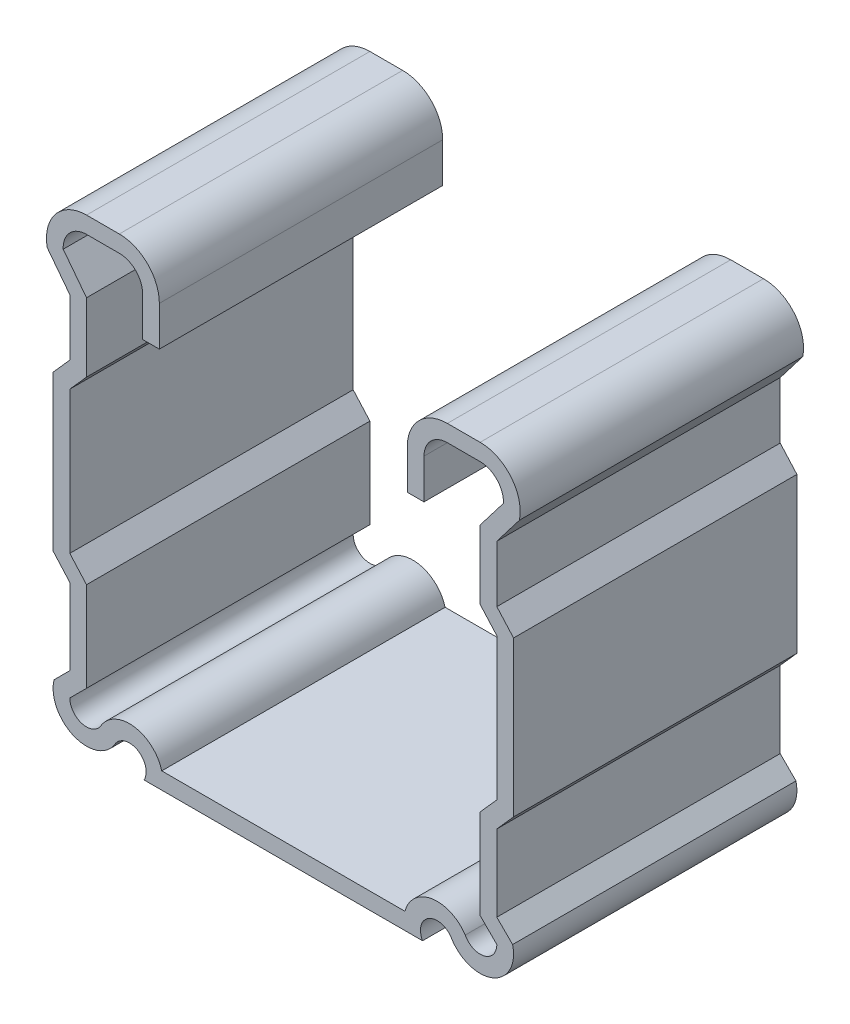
from build123d import *

# Parameters (mm, degrees)
BASE_EXTRUDE_DEPTH = 12.7


with BuildPart() as part:
    # Sketch1 → Base-Extrude (new, symmetric)
    with BuildSketch(Plane.XY):
        with BuildLine():
            Line((17.6403, 16.339286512), (19.729882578, 19.063533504))
            ThreePointArc((19.729882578, 19.063533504), (19.156045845, 20.609744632), (17.6403, 21.2598))
            Line((17.6403, 21.2598), (14.70327367, 21.2598))
            ThreePointArc((14.70327367, 21.2598), (13.223883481, 20.647016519), (12.6111, 19.16762633))
            Line((12.6111, 19.16762633), (12.6111, 15.61465))
            Line((12.6111, 15.61465), (11.1125, 15.61465))
            Line((11.1125, 15.61465), (11.1125, 19.16762633))
            ThreePointArc((11.1125, 19.16762633), (12.164213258, 21.706686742), (14.70327367, 22.7584))
            Line((14.70327367, 22.7584), (17.6403, 22.7584))
            ThreePointArc((17.6403, 22.7584), (20.415434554, 21.446284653), (21.162428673, 18.4688666))
            Line((21.162428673, 18.4688666), (19.1389, 15.830735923))
            Line((19.1389, 15.830735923), (19.1389, 10.749129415))
            Line((19.1389, 10.749129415), (20.6375, 9.0662125))
            Line((20.6375, 9.0662125), (20.6375, -4.8244125))
            Line((20.6375, -4.8244125), (19.1389, -6.507329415))
            Line((19.1389, -6.507329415), (19.1389, -13.358784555))
            Line((19.1389, -13.358784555), (20.553458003, -14.773342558))
            ThreePointArc((20.553458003, -14.773342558), (18.729942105, -18.270236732), (15.019825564, -16.932883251))
            ThreePointArc((15.019825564, -16.932883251), (13.000752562, -16.523120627), (12.480559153, -18.5166))
            Line((12.480559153, -18.5166), (-12.480559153, -18.5166))
            ThreePointArc((-12.480559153, -18.5166), (-13.000752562, -16.523120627), (-15.019825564, -16.932883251))
            ThreePointArc((-15.019825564, -16.932883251), (-18.729942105, -18.270236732), (-20.553458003, -14.773342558))
            Line((-20.553458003, -14.773342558), (-19.1389, -13.358784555))
            Line((-19.1389, -13.358784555), (-19.1389, -6.507329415))
            Line((-19.1389, -6.507329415), (-20.6375, -4.8244125))
            Line((-20.6375, -4.8244125), (-20.6375, 9.0662125))
            Line((-20.6375, 9.0662125), (-19.1389, 10.749129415))
            Line((-19.1389, 10.749129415), (-19.1389, 15.830735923))
            Line((-19.1389, 15.830735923), (-21.162428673, 18.4688666))
            ThreePointArc((-21.162428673, 18.4688666), (-20.415434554, 21.446284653), (-17.6403, 22.7584))
            Line((-17.6403, 22.7584), (-14.70327367, 22.7584))
            ThreePointArc((-14.70327367, 22.7584), (-12.164213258, 21.706686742), (-11.1125, 19.16762633))
            Line((-11.1125, 19.16762633), (-11.1125, 15.61465))
            Line((-11.1125, 15.61465), (-12.6111, 15.61465))
            Line((-12.6111, 15.61465), (-12.6111, 19.16762633))
            ThreePointArc((-12.6111, 19.16762633), (-13.223883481, 20.647016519), (-14.70327367, 21.2598))
            Line((-14.70327367, 21.2598), (-17.6403, 21.2598))
            ThreePointArc((-17.6403, 21.2598), (-19.156045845, 20.609744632), (-19.729882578, 19.063533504))
            Line((-19.729882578, 19.063533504), (-17.6403, 16.339286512))
            Line((-17.6403, 16.339286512), (-17.6403, 10.17860201))
            Line((-17.6403, 10.17860201), (-19.1389, 8.495685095))
            Line((-19.1389, 8.495685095), (-19.1389, -4.253885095))
            Line((-19.1389, -4.253885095), (-17.6403, -5.93680201))
            Line((-17.6403, -5.93680201), (-17.6403, -13.979525))
            Line((-17.6403, -13.979525), (-19.1389, -15.478125))
            ThreePointArc((-19.1389, -15.478125), (-18.092238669, -16.906954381), (-16.414285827, -16.33992034))
            ThreePointArc((-16.414285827, -16.33992034), (-13.428073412, -14.819877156), (-10.898992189, -17.018))
            Line((-10.898992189, -17.018), (10.898992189, -17.018))
            ThreePointArc((10.898992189, -17.018), (13.323359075, -14.834630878), (16.30518861, -16.15877141))
            ThreePointArc((16.30518861, -16.15877141), (17.990302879, -16.935279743), (19.1389, -15.478125))
            Line((19.1389, -15.478125), (17.6403, -13.979525))
            Line((17.6403, -13.979525), (17.6403, -5.93680201))
            Line((17.6403, -5.93680201), (19.1389, -4.253885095))
            Line((19.1389, -4.253885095), (19.1389, 8.495685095))
            Line((19.1389, 8.495685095), (17.6403, 10.17860201))
            Line((17.6403, 10.17860201), (17.6403, 16.339286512))
        make_face()
    extrude(amount=BASE_EXTRUDE_DEPTH, both=True)


solid = part.part
